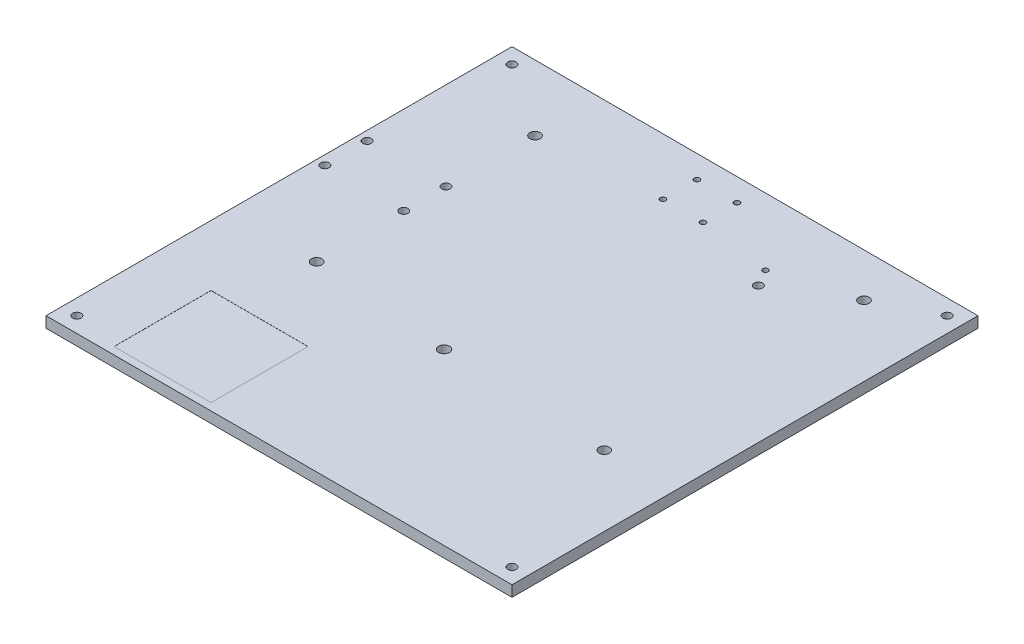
ISO-10303-21;
HEADER;
FILE_DESCRIPTION(('STEP AP214'),'2;1');
FILE_NAME('part.step','',(''),(''),'','','');
FILE_SCHEMA(('AUTOMOTIVE_DESIGN { 1 0 10303 214 1 1 1 1 }'));
ENDSEC;
DATA;
#1=APPLICATION_CONTEXT('core data for automotive mechanical design processes');
#2=APPLICATION_PROTOCOL_DEFINITION('international standard','automotive_design',2000,#1);
#3=PRODUCT_CONTEXT('',#1,'mechanical');
#4=PRODUCT('Part','Part','',(#3));
#5=PRODUCT_RELATED_PRODUCT_CATEGORY('part','',(#4));
#6=PRODUCT_DEFINITION_FORMATION('','',#4);
#7=PRODUCT_DEFINITION_CONTEXT('part definition',#1,'design');
#8=PRODUCT_DEFINITION('design','',#6,#7);
#9=PRODUCT_DEFINITION_SHAPE('','',#8);
#10=(LENGTH_UNIT() NAMED_UNIT(*) SI_UNIT(.MILLI.,.METRE.));
#11=(NAMED_UNIT(*) PLANE_ANGLE_UNIT() SI_UNIT($,.RADIAN.));
#12=(NAMED_UNIT(*) SI_UNIT($,.STERADIAN.) SOLID_ANGLE_UNIT());
#13=UNCERTAINTY_MEASURE_WITH_UNIT(LENGTH_MEASURE(1.E-05),#10,'distance_accuracy_value','');
#14=(GEOMETRIC_REPRESENTATION_CONTEXT(3) GLOBAL_UNCERTAINTY_ASSIGNED_CONTEXT((#13)) GLOBAL_UNIT_ASSIGNED_CONTEXT((#10,
#11,#12)) REPRESENTATION_CONTEXT('',''));
#15=CARTESIAN_POINT('',(0.,0.,0.));
#16=DIRECTION('',(0.,0.,1.));
#17=DIRECTION('',(1.,0.,0.));
#18=AXIS2_PLACEMENT_3D('',#15,#16,#17);
#19=CARTESIAN_POINT('',(0.,9.,0.));
#20=DIRECTION('',(0.,1.,0.));
#21=DIRECTION('',(0.,0.,1.));
#22=AXIS2_PLACEMENT_3D('',#19,#20,#21);
#23=PLANE('',#22);
#24=DIRECTION('',(0.,0.,1.));
#25=VECTOR('',#24,1.);
#26=CARTESIAN_POINT('',(58.5217380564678,9.,0.));
#27=LINE('',#26,#25);
#28=CARTESIAN_POINT('',(58.5217380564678,9.,-104.472034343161));
#29=VERTEX_POINT('',#28);
#30=CARTESIAN_POINT('',(58.5217380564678,9.,-24.4720343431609));
#31=VERTEX_POINT('',#30);
#32=EDGE_CURVE('E48',#29,#31,#27,.T.);
#33=ORIENTED_EDGE('',*,*,#32,.F.);
#34=DIRECTION('',(-1.,0.,0.));
#35=VECTOR('',#34,1.);
#36=CARTESIAN_POINT('',(0.,9.,-104.472034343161));
#37=LINE('',#36,#35);
#38=CARTESIAN_POINT('',(138.521738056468,9.,-104.472034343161));
#39=VERTEX_POINT('',#38);
#40=EDGE_CURVE('E127',#39,#29,#37,.T.);
#41=ORIENTED_EDGE('',*,*,#40,.F.);
#42=DIRECTION('',(0.,0.,-1.));
#43=VECTOR('',#42,1.);
#44=CARTESIAN_POINT('',(138.521738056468,9.,0.));
#45=LINE('',#44,#43);
#46=CARTESIAN_POINT('',(138.521738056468,9.,-24.4720343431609));
#47=VERTEX_POINT('',#46);
#48=EDGE_CURVE('E130',#47,#39,#45,.T.);
#49=ORIENTED_EDGE('',*,*,#48,.F.);
#50=DIRECTION('',(1.,0.,0.));
#51=VECTOR('',#50,1.);
#52=CARTESIAN_POINT('',(0.,9.,-24.4720343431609));
#53=LINE('',#52,#51);
#54=EDGE_CURVE('E136',#31,#47,#53,.T.);
#55=ORIENTED_EDGE('',*,*,#54,.F.);
#56=EDGE_LOOP('',(#33,#41,#49,#55));
#57=FACE_BOUND('',#56,.T.);
#58=CARTESIAN_POINT('',(212.621738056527,9.,-355.772034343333));
#59=DIRECTION('',(0.,1.,0.));
#60=DIRECTION('',(0.,0.,1.));
#61=AXIS2_PLACEMENT_3D('',#58,#59,#60);
#62=CIRCLE('',#61,2.25000000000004);
#63=CARTESIAN_POINT('',(212.621738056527,9.,-353.522034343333));
#64=VERTEX_POINT('',#63);
#65=EDGE_CURVE('E152',#64,#64,#62,.T.);
#66=ORIENTED_EDGE('',*,*,#65,.F.);
#67=EDGE_LOOP('',(#66));
#68=FACE_BOUND('',#67,.T.);
#69=CARTESIAN_POINT('',(179.621738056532,9.,-383.772034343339));
#70=DIRECTION('',(0.,1.,0.));
#71=DIRECTION('',(0.,0.,1.));
#72=AXIS2_PLACEMENT_3D('',#69,#70,#71);
#73=CIRCLE('',#72,2.25000000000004);
#74=CARTESIAN_POINT('',(179.621738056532,9.,-381.522034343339));
#75=VERTEX_POINT('',#74);
#76=EDGE_CURVE('E164',#75,#75,#73,.T.);
#77=ORIENTED_EDGE('',*,*,#76,.F.);
#78=EDGE_LOOP('',(#77));
#79=FACE_BOUND('',#78,.T.);
#80=CARTESIAN_POINT('',(81.0943470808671,9.,-275.472034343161));
#81=DIRECTION('',(0.,1.,0.));
#82=DIRECTION('',(0.,0.,1.));
#83=AXIS2_PLACEMENT_3D('',#80,#81,#82);
#84=CIRCLE('',#83,3.49999999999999);
#85=CARTESIAN_POINT('',(81.0943470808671,9.,-271.972034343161));
#86=VERTEX_POINT('',#85);
#87=EDGE_CURVE('E176',#86,#86,#84,.T.);
#88=ORIENTED_EDGE('',*,*,#87,.F.);
#89=EDGE_LOOP('',(#88));
#90=FACE_BOUND('',#89,.T.);
#91=CARTESIAN_POINT('',(16.0943470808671,9.,-240.696340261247));
#92=DIRECTION('',(0.,1.,0.));
#93=DIRECTION('',(0.,0.,1.));
#94=AXIS2_PLACEMENT_3D('',#91,#92,#93);
#95=CIRCLE('',#94,3.5);
#96=CARTESIAN_POINT('',(16.0943470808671,9.,-237.196340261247));
#97=VERTEX_POINT('',#96);
#98=EDGE_CURVE('E188',#97,#97,#95,.T.);
#99=ORIENTED_EDGE('',*,*,#98,.F.);
#100=EDGE_LOOP('',(#99));
#101=FACE_BOUND('',#100,.T.);
#102=CARTESIAN_POINT('',(379.821738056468,9.,-31.1720343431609));
#103=DIRECTION('',(0.,1.,0.));
#104=DIRECTION('',(0.,0.,1.));
#105=AXIS2_PLACEMENT_3D('',#102,#103,#104);
#106=CIRCLE('',#105,3.50000000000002);
#107=CARTESIAN_POINT('',(379.821738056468,9.,-27.6720343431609));
#108=VERTEX_POINT('',#107);
#109=EDGE_CURVE('E200',#108,#108,#106,.T.);
#110=ORIENTED_EDGE('',*,*,#109,.F.);
#111=EDGE_LOOP('',(#110));
#112=FACE_BOUND('',#111,.T.);
#113=CARTESIAN_POINT('',(272.521738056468,9.,-347.328440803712));
#114=DIRECTION('',(0.,1.,0.));
#115=DIRECTION('',(0.,0.,1.));
#116=AXIS2_PLACEMENT_3D('',#113,#114,#115);
#117=CIRCLE('',#116,2.19999999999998);
#118=CARTESIAN_POINT('',(272.521738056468,9.,-345.128440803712));
#119=VERTEX_POINT('',#118);
#120=EDGE_CURVE('E212',#119,#119,#117,.T.);
#121=ORIENTED_EDGE('',*,*,#120,.F.);
#122=EDGE_LOOP('',(#121));
#123=FACE_BOUND('',#122,.T.);
#124=CARTESIAN_POINT('',(334.521738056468,9.,-152.472034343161));
#125=DIRECTION('',(0.,1.,0.));
#126=DIRECTION('',(0.,0.,1.));
#127=AXIS2_PLACEMENT_3D('',#124,#125,#126);
#128=CIRCLE('',#127,4.30000000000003);
#129=CARTESIAN_POINT('',(334.521738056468,9.,-148.172034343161));
#130=VERTEX_POINT('',#129);
#131=EDGE_CURVE('E224',#130,#130,#128,.T.);
#132=ORIENTED_EDGE('',*,*,#131,.F.);
#133=EDGE_LOOP('',(#132));
#134=FACE_BOUND('',#133,.T.);
#135=CARTESIAN_POINT('',(379.821738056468,9.,-389.772034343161));
#136=DIRECTION('',(0.,1.,0.));
#137=DIRECTION('',(0.,0.,1.));
#138=AXIS2_PLACEMENT_3D('',#135,#136,#137);
#139=CIRCLE('',#138,3.50000000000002);
#140=CARTESIAN_POINT('',(379.821738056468,9.,-386.272034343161));
#141=VERTEX_POINT('',#140);
#142=EDGE_CURVE('E236',#141,#141,#139,.T.);
#143=ORIENTED_EDGE('',*,*,#142,.F.);
#144=EDGE_LOOP('',(#143));
#145=FACE_BOUND('',#144,.T.);
#146=CARTESIAN_POINT('',(280.521738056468,9.,-333.472034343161));
#147=DIRECTION('',(0.,1.,0.));
#148=DIRECTION('',(0.,0.,1.));
#149=AXIS2_PLACEMENT_3D('',#146,#147,#148);
#150=CIRCLE('',#149,3.50000000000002);
#151=CARTESIAN_POINT('',(280.521738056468,9.,-329.972034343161));
#152=VERTEX_POINT('',#151);
#153=EDGE_CURVE('E248',#152,#152,#150,.T.);
#154=ORIENTED_EDGE('',*,*,#153,.F.);
#155=EDGE_LOOP('',(#154));
#156=FACE_BOUND('',#155,.T.);
#157=DIRECTION('',(0.,0.,1.));
#158=VECTOR('',#157,1.);
#159=CARTESIAN_POINT('',(8.52173805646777,9.,-402.472034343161));
#160=LINE('',#159,#158);
#161=CARTESIAN_POINT('',(8.52173805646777,9.,-402.472034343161));
#162=VERTEX_POINT('',#161);
#163=CARTESIAN_POINT('',(8.52173805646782,9.,-18.4720343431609));
#164=VERTEX_POINT('',#163);
#165=EDGE_CURVE('E260',#162,#164,#160,.T.);
#166=ORIENTED_EDGE('',*,*,#165,.T.);
#167=DIRECTION('',(1.,0.,0.));
#168=VECTOR('',#167,1.);
#169=CARTESIAN_POINT('',(8.52173805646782,9.,-18.4720343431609));
#170=LINE('',#169,#168);
#171=CARTESIAN_POINT('',(392.521738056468,9.,-18.4720343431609));
#172=VERTEX_POINT('',#171);
#173=EDGE_CURVE('E85',#164,#172,#170,.T.);
#174=ORIENTED_EDGE('',*,*,#173,.T.);
#175=DIRECTION('',(0.,0.,-1.));
#176=VECTOR('',#175,1.);
#177=CARTESIAN_POINT('',(392.521738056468,9.,-402.472034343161));
#178=LINE('',#177,#176);
#179=CARTESIAN_POINT('',(392.521738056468,9.,-402.472034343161));
#180=VERTEX_POINT('',#179);
#181=EDGE_CURVE('E263',#172,#180,#178,.T.);
#182=ORIENTED_EDGE('',*,*,#181,.T.);
#183=DIRECTION('',(-1.,0.,0.));
#184=VECTOR('',#183,1.);
#185=CARTESIAN_POINT('',(8.52173805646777,9.,-402.472034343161));
#186=LINE('',#185,#184);
#187=EDGE_CURVE('E57',#180,#162,#186,.T.);
#188=ORIENTED_EDGE('',*,*,#187,.T.);
#189=EDGE_LOOP('',(#166,#174,#182,#188));
#190=FACE_BOUND('',#189,.T.);
#191=CARTESIAN_POINT('',(21.2217380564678,9.,-389.772034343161));
#192=DIRECTION('',(0.,1.,0.));
#193=DIRECTION('',(0.,0.,1.));
#194=AXIS2_PLACEMENT_3D('',#191,#192,#193);
#195=CIRCLE('',#194,3.5);
#196=CARTESIAN_POINT('',(21.2217380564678,9.,-386.272034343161));
#197=VERTEX_POINT('',#196);
#198=EDGE_CURVE('E254',#197,#197,#195,.T.);
#199=ORIENTED_EDGE('',*,*,#198,.F.);
#200=EDGE_LOOP('',(#199));
#201=FACE_BOUND('',#200,.T.);
#202=CARTESIAN_POINT('',(81.5217380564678,9.,-348.472034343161));
#203=DIRECTION('',(0.,1.,0.));
#204=DIRECTION('',(0.,0.,1.));
#205=AXIS2_PLACEMENT_3D('',#202,#203,#204);
#206=CIRCLE('',#205,4.30000000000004);
#207=CARTESIAN_POINT('',(81.5217380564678,9.,-344.172034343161));
#208=VERTEX_POINT('',#207);
#209=EDGE_CURVE('E242',#208,#208,#206,.T.);
#210=ORIENTED_EDGE('',*,*,#209,.F.);
#211=EDGE_LOOP('',(#210));
#212=FACE_BOUND('',#211,.T.);
#213=CARTESIAN_POINT('',(196.521738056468,9.,-158.472034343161));
#214=DIRECTION('',(0.,1.,0.));
#215=DIRECTION('',(0.,0.,1.));
#216=AXIS2_PLACEMENT_3D('',#213,#214,#215);
#217=CIRCLE('',#216,4.49999999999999);
#218=CARTESIAN_POINT('',(196.521738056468,9.,-153.972034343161));
#219=VERTEX_POINT('',#218);
#220=EDGE_CURVE('E230',#219,#219,#217,.T.);
#221=ORIENTED_EDGE('',*,*,#220,.F.);
#222=EDGE_LOOP('',(#221));
#223=FACE_BOUND('',#222,.T.);
#224=CARTESIAN_POINT('',(81.5217380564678,9.,-168.472034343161));
#225=DIRECTION('',(0.,1.,0.));
#226=DIRECTION('',(0.,0.,1.));
#227=AXIS2_PLACEMENT_3D('',#224,#225,#226);
#228=CIRCLE('',#227,4.3);
#229=CARTESIAN_POINT('',(81.5217380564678,9.,-164.172034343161));
#230=VERTEX_POINT('',#229);
#231=EDGE_CURVE('E218',#230,#230,#228,.T.);
#232=ORIENTED_EDGE('',*,*,#231,.F.);
#233=EDGE_LOOP('',(#232));
#234=FACE_BOUND('',#233,.T.);
#235=CARTESIAN_POINT('',(334.521738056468,9.,-366.472034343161));
#236=DIRECTION('',(0.,1.,0.));
#237=DIRECTION('',(0.,0.,1.));
#238=AXIS2_PLACEMENT_3D('',#235,#236,#237);
#239=CIRCLE('',#238,4.30000000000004);
#240=CARTESIAN_POINT('',(334.521738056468,9.,-362.172034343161));
#241=VERTEX_POINT('',#240);
#242=EDGE_CURVE('E206',#241,#241,#239,.T.);
#243=ORIENTED_EDGE('',*,*,#242,.F.);
#244=EDGE_LOOP('',(#243));
#245=FACE_BOUND('',#244,.T.);
#246=CARTESIAN_POINT('',(21.2217380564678,9.,-31.1720343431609));
#247=DIRECTION('',(0.,1.,0.));
#248=DIRECTION('',(0.,0.,1.));
#249=AXIS2_PLACEMENT_3D('',#246,#247,#248);
#250=CIRCLE('',#249,3.5);
#251=CARTESIAN_POINT('',(21.2217380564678,9.,-27.6720343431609));
#252=VERTEX_POINT('',#251);
#253=EDGE_CURVE('E194',#252,#252,#250,.T.);
#254=ORIENTED_EDGE('',*,*,#253,.F.);
#255=EDGE_LOOP('',(#254));
#256=FACE_BOUND('',#255,.T.);
#257=CARTESIAN_POINT('',(16.0943470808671,9.,-275.472034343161));
#258=DIRECTION('',(0.,1.,0.));
#259=DIRECTION('',(0.,0.,1.));
#260=AXIS2_PLACEMENT_3D('',#257,#258,#259);
#261=CIRCLE('',#260,3.49999999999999);
#262=CARTESIAN_POINT('',(16.0943470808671,9.,-271.972034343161));
#263=VERTEX_POINT('',#262);
#264=EDGE_CURVE('E182',#263,#263,#261,.T.);
#265=ORIENTED_EDGE('',*,*,#264,.F.);
#266=EDGE_LOOP('',(#265));
#267=FACE_BOUND('',#266,.T.);
#268=CARTESIAN_POINT('',(81.0943470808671,9.,-240.696340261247));
#269=DIRECTION('',(0.,1.,0.));
#270=DIRECTION('',(0.,0.,1.));
#271=AXIS2_PLACEMENT_3D('',#268,#269,#270);
#272=CIRCLE('',#271,3.49999999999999);
#273=CARTESIAN_POINT('',(81.0943470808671,9.,-237.196340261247));
#274=VERTEX_POINT('',#273);
#275=EDGE_CURVE('E170',#274,#274,#272,.T.);
#276=ORIENTED_EDGE('',*,*,#275,.F.);
#277=EDGE_LOOP('',(#276));
#278=FACE_BOUND('',#277,.T.);
#279=CARTESIAN_POINT('',(179.621738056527,9.,-355.772034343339));
#280=DIRECTION('',(0.,1.,0.));
#281=DIRECTION('',(0.,0.,1.));
#282=AXIS2_PLACEMENT_3D('',#279,#280,#281);
#283=CIRCLE('',#282,2.24999999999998);
#284=CARTESIAN_POINT('',(179.621738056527,9.,-353.522034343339));
#285=VERTEX_POINT('',#284);
#286=EDGE_CURVE('E158',#285,#285,#283,.T.);
#287=ORIENTED_EDGE('',*,*,#286,.F.);
#288=EDGE_LOOP('',(#287));
#289=FACE_BOUND('',#288,.T.);
#290=CARTESIAN_POINT('',(212.621738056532,9.,-383.772034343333));
#291=DIRECTION('',(0.,1.,0.));
#292=DIRECTION('',(0.,0.,1.));
#293=AXIS2_PLACEMENT_3D('',#290,#291,#292);
#294=CIRCLE('',#293,2.24999999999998);
#295=CARTESIAN_POINT('',(212.621738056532,9.,-381.522034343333));
#296=VERTEX_POINT('',#295);
#297=EDGE_CURVE('E146',#296,#296,#294,.T.);
#298=ORIENTED_EDGE('',*,*,#297,.F.);
#299=EDGE_LOOP('',(#298));
#300=FACE_BOUND('',#299,.T.);
#301=ADVANCED_FACE('F33',(#57,#68,#79,#90,#101,#112,#123,#134,#145,#156,#190,#201,#212,#223,
#234,#245,#256,#267,#278,#289,#300),#23,.T.);
#302=CARTESIAN_POINT('',(0.,0.,0.));
#303=DIRECTION('',(0.,1.,0.));
#304=DIRECTION('',(0.,0.,1.));
#305=AXIS2_PLACEMENT_3D('',#302,#303,#304);
#306=PLANE('',#305);
#307=DIRECTION('',(0.,0.,1.));
#308=VECTOR('',#307,1.);
#309=CARTESIAN_POINT('',(8.52173805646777,0.,-402.472034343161));
#310=LINE('',#309,#308);
#311=CARTESIAN_POINT('',(8.52173805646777,0.,-402.472034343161));
#312=VERTEX_POINT('',#311);
#313=CARTESIAN_POINT('',(8.52173805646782,0.,-18.4720343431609));
#314=VERTEX_POINT('',#313);
#315=EDGE_CURVE('E257',#312,#314,#310,.T.);
#316=ORIENTED_EDGE('',*,*,#315,.F.);
#317=DIRECTION('',(-1.,0.,0.));
#318=VECTOR('',#317,1.);
#319=CARTESIAN_POINT('',(8.52173805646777,0.,-402.472034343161));
#320=LINE('',#319,#318);
#321=CARTESIAN_POINT('',(392.521738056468,0.,-402.472034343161));
#322=VERTEX_POINT('',#321);
#323=EDGE_CURVE('E78',#322,#312,#320,.T.);
#324=ORIENTED_EDGE('',*,*,#323,.F.);
#325=DIRECTION('',(0.,0.,-1.));
#326=VECTOR('',#325,1.);
#327=CARTESIAN_POINT('',(392.521738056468,0.,-402.472034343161));
#328=LINE('',#327,#326);
#329=CARTESIAN_POINT('',(392.521738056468,0.,-18.4720343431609));
#330=VERTEX_POINT('',#329);
#331=EDGE_CURVE('E271',#330,#322,#328,.T.);
#332=ORIENTED_EDGE('',*,*,#331,.F.);
#333=DIRECTION('',(1.,0.,0.));
#334=VECTOR('',#333,1.);
#335=CARTESIAN_POINT('',(8.52173805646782,0.,-18.4720343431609));
#336=LINE('',#335,#334);
#337=EDGE_CURVE('E269',#314,#330,#336,.T.);
#338=ORIENTED_EDGE('',*,*,#337,.F.);
#339=EDGE_LOOP('',(#316,#324,#332,#338));
#340=FACE_BOUND('',#339,.T.);
#341=CARTESIAN_POINT('',(21.2217380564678,0.,-389.772034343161));
#342=DIRECTION('',(0.,1.,0.));
#343=DIRECTION('',(0.,0.,1.));
#344=AXIS2_PLACEMENT_3D('',#341,#342,#343);
#345=CIRCLE('',#344,3.5);
#346=CARTESIAN_POINT('',(21.2217380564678,0.,-386.272034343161));
#347=VERTEX_POINT('',#346);
#348=EDGE_CURVE('E251',#347,#347,#345,.T.);
#349=ORIENTED_EDGE('',*,*,#348,.T.);
#350=EDGE_LOOP('',(#349));
#351=FACE_BOUND('',#350,.T.);
#352=CARTESIAN_POINT('',(280.521738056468,0.,-333.472034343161));
#353=DIRECTION('',(0.,1.,0.));
#354=DIRECTION('',(0.,0.,1.));
#355=AXIS2_PLACEMENT_3D('',#352,#353,#354);
#356=CIRCLE('',#355,3.50000000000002);
#357=CARTESIAN_POINT('',(280.521738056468,0.,-329.972034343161));
#358=VERTEX_POINT('',#357);
#359=EDGE_CURVE('E245',#358,#358,#356,.T.);
#360=ORIENTED_EDGE('',*,*,#359,.T.);
#361=EDGE_LOOP('',(#360));
#362=FACE_BOUND('',#361,.T.);
#363=CARTESIAN_POINT('',(81.5217380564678,0.,-348.472034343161));
#364=DIRECTION('',(0.,1.,0.));
#365=DIRECTION('',(0.,0.,1.));
#366=AXIS2_PLACEMENT_3D('',#363,#364,#365);
#367=CIRCLE('',#366,4.30000000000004);
#368=CARTESIAN_POINT('',(81.5217380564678,0.,-344.172034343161));
#369=VERTEX_POINT('',#368);
#370=EDGE_CURVE('E239',#369,#369,#367,.T.);
#371=ORIENTED_EDGE('',*,*,#370,.T.);
#372=EDGE_LOOP('',(#371));
#373=FACE_BOUND('',#372,.T.);
#374=CARTESIAN_POINT('',(379.821738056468,0.,-389.772034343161));
#375=DIRECTION('',(0.,1.,0.));
#376=DIRECTION('',(0.,0.,1.));
#377=AXIS2_PLACEMENT_3D('',#374,#375,#376);
#378=CIRCLE('',#377,3.50000000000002);
#379=CARTESIAN_POINT('',(379.821738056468,0.,-386.272034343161));
#380=VERTEX_POINT('',#379);
#381=EDGE_CURVE('E233',#380,#380,#378,.T.);
#382=ORIENTED_EDGE('',*,*,#381,.T.);
#383=EDGE_LOOP('',(#382));
#384=FACE_BOUND('',#383,.T.);
#385=CARTESIAN_POINT('',(196.521738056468,0.,-158.472034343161));
#386=DIRECTION('',(0.,1.,0.));
#387=DIRECTION('',(0.,0.,1.));
#388=AXIS2_PLACEMENT_3D('',#385,#386,#387);
#389=CIRCLE('',#388,4.49999999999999);
#390=CARTESIAN_POINT('',(196.521738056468,0.,-153.972034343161));
#391=VERTEX_POINT('',#390);
#392=EDGE_CURVE('E227',#391,#391,#389,.T.);
#393=ORIENTED_EDGE('',*,*,#392,.T.);
#394=EDGE_LOOP('',(#393));
#395=FACE_BOUND('',#394,.T.);
#396=CARTESIAN_POINT('',(334.521738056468,0.,-152.472034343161));
#397=DIRECTION('',(0.,1.,0.));
#398=DIRECTION('',(0.,0.,1.));
#399=AXIS2_PLACEMENT_3D('',#396,#397,#398);
#400=CIRCLE('',#399,4.30000000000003);
#401=CARTESIAN_POINT('',(334.521738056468,0.,-148.172034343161));
#402=VERTEX_POINT('',#401);
#403=EDGE_CURVE('E221',#402,#402,#400,.T.);
#404=ORIENTED_EDGE('',*,*,#403,.T.);
#405=EDGE_LOOP('',(#404));
#406=FACE_BOUND('',#405,.T.);
#407=CARTESIAN_POINT('',(81.5217380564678,0.,-168.472034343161));
#408=DIRECTION('',(0.,1.,0.));
#409=DIRECTION('',(0.,0.,1.));
#410=AXIS2_PLACEMENT_3D('',#407,#408,#409);
#411=CIRCLE('',#410,4.3);
#412=CARTESIAN_POINT('',(81.5217380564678,0.,-164.172034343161));
#413=VERTEX_POINT('',#412);
#414=EDGE_CURVE('E215',#413,#413,#411,.T.);
#415=ORIENTED_EDGE('',*,*,#414,.T.);
#416=EDGE_LOOP('',(#415));
#417=FACE_BOUND('',#416,.T.);
#418=CARTESIAN_POINT('',(272.521738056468,0.,-347.328440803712));
#419=DIRECTION('',(0.,1.,0.));
#420=DIRECTION('',(0.,0.,1.));
#421=AXIS2_PLACEMENT_3D('',#418,#419,#420);
#422=CIRCLE('',#421,2.19999999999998);
#423=CARTESIAN_POINT('',(272.521738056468,0.,-345.128440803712));
#424=VERTEX_POINT('',#423);
#425=EDGE_CURVE('E209',#424,#424,#422,.T.);
#426=ORIENTED_EDGE('',*,*,#425,.T.);
#427=EDGE_LOOP('',(#426));
#428=FACE_BOUND('',#427,.T.);
#429=CARTESIAN_POINT('',(334.521738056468,0.,-366.472034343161));
#430=DIRECTION('',(0.,1.,0.));
#431=DIRECTION('',(0.,0.,1.));
#432=AXIS2_PLACEMENT_3D('',#429,#430,#431);
#433=CIRCLE('',#432,4.30000000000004);
#434=CARTESIAN_POINT('',(334.521738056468,0.,-362.172034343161));
#435=VERTEX_POINT('',#434);
#436=EDGE_CURVE('E203',#435,#435,#433,.T.);
#437=ORIENTED_EDGE('',*,*,#436,.T.);
#438=EDGE_LOOP('',(#437));
#439=FACE_BOUND('',#438,.T.);
#440=CARTESIAN_POINT('',(379.821738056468,0.,-31.1720343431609));
#441=DIRECTION('',(0.,1.,0.));
#442=DIRECTION('',(0.,0.,1.));
#443=AXIS2_PLACEMENT_3D('',#440,#441,#442);
#444=CIRCLE('',#443,3.50000000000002);
#445=CARTESIAN_POINT('',(379.821738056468,0.,-27.6720343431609));
#446=VERTEX_POINT('',#445);
#447=EDGE_CURVE('E197',#446,#446,#444,.T.);
#448=ORIENTED_EDGE('',*,*,#447,.T.);
#449=EDGE_LOOP('',(#448));
#450=FACE_BOUND('',#449,.T.);
#451=CARTESIAN_POINT('',(21.2217380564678,0.,-31.1720343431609));
#452=DIRECTION('',(0.,1.,0.));
#453=DIRECTION('',(0.,0.,1.));
#454=AXIS2_PLACEMENT_3D('',#451,#452,#453);
#455=CIRCLE('',#454,3.5);
#456=CARTESIAN_POINT('',(21.2217380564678,0.,-27.6720343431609));
#457=VERTEX_POINT('',#456);
#458=EDGE_CURVE('E191',#457,#457,#455,.T.);
#459=ORIENTED_EDGE('',*,*,#458,.T.);
#460=EDGE_LOOP('',(#459));
#461=FACE_BOUND('',#460,.T.);
#462=CARTESIAN_POINT('',(16.0943470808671,0.,-240.696340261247));
#463=DIRECTION('',(0.,1.,0.));
#464=DIRECTION('',(0.,0.,1.));
#465=AXIS2_PLACEMENT_3D('',#462,#463,#464);
#466=CIRCLE('',#465,3.5);
#467=CARTESIAN_POINT('',(16.0943470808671,0.,-237.196340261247));
#468=VERTEX_POINT('',#467);
#469=EDGE_CURVE('E185',#468,#468,#466,.T.);
#470=ORIENTED_EDGE('',*,*,#469,.T.);
#471=EDGE_LOOP('',(#470));
#472=FACE_BOUND('',#471,.T.);
#473=CARTESIAN_POINT('',(16.0943470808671,0.,-275.472034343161));
#474=DIRECTION('',(0.,1.,0.));
#475=DIRECTION('',(0.,0.,1.));
#476=AXIS2_PLACEMENT_3D('',#473,#474,#475);
#477=CIRCLE('',#476,3.49999999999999);
#478=CARTESIAN_POINT('',(16.0943470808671,0.,-271.972034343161));
#479=VERTEX_POINT('',#478);
#480=EDGE_CURVE('E179',#479,#479,#477,.T.);
#481=ORIENTED_EDGE('',*,*,#480,.T.);
#482=EDGE_LOOP('',(#481));
#483=FACE_BOUND('',#482,.T.);
#484=CARTESIAN_POINT('',(81.0943470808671,0.,-275.472034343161));
#485=DIRECTION('',(0.,1.,0.));
#486=DIRECTION('',(0.,0.,1.));
#487=AXIS2_PLACEMENT_3D('',#484,#485,#486);
#488=CIRCLE('',#487,3.49999999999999);
#489=CARTESIAN_POINT('',(81.0943470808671,0.,-271.972034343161));
#490=VERTEX_POINT('',#489);
#491=EDGE_CURVE('E173',#490,#490,#488,.T.);
#492=ORIENTED_EDGE('',*,*,#491,.T.);
#493=EDGE_LOOP('',(#492));
#494=FACE_BOUND('',#493,.T.);
#495=CARTESIAN_POINT('',(81.0943470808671,0.,-240.696340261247));
#496=DIRECTION('',(0.,1.,0.));
#497=DIRECTION('',(0.,0.,1.));
#498=AXIS2_PLACEMENT_3D('',#495,#496,#497);
#499=CIRCLE('',#498,3.49999999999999);
#500=CARTESIAN_POINT('',(81.0943470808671,0.,-237.196340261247));
#501=VERTEX_POINT('',#500);
#502=EDGE_CURVE('E167',#501,#501,#499,.T.);
#503=ORIENTED_EDGE('',*,*,#502,.T.);
#504=EDGE_LOOP('',(#503));
#505=FACE_BOUND('',#504,.T.);
#506=CARTESIAN_POINT('',(179.621738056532,0.,-383.772034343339));
#507=DIRECTION('',(0.,1.,0.));
#508=DIRECTION('',(0.,0.,1.));
#509=AXIS2_PLACEMENT_3D('',#506,#507,#508);
#510=CIRCLE('',#509,2.25000000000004);
#511=CARTESIAN_POINT('',(179.621738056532,0.,-381.522034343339));
#512=VERTEX_POINT('',#511);
#513=EDGE_CURVE('E161',#512,#512,#510,.T.);
#514=ORIENTED_EDGE('',*,*,#513,.T.);
#515=EDGE_LOOP('',(#514));
#516=FACE_BOUND('',#515,.T.);
#517=CARTESIAN_POINT('',(179.621738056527,0.,-355.772034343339));
#518=DIRECTION('',(0.,1.,0.));
#519=DIRECTION('',(0.,0.,1.));
#520=AXIS2_PLACEMENT_3D('',#517,#518,#519);
#521=CIRCLE('',#520,2.24999999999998);
#522=CARTESIAN_POINT('',(179.621738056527,0.,-353.522034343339));
#523=VERTEX_POINT('',#522);
#524=EDGE_CURVE('E155',#523,#523,#521,.T.);
#525=ORIENTED_EDGE('',*,*,#524,.T.);
#526=EDGE_LOOP('',(#525));
#527=FACE_BOUND('',#526,.T.);
#528=CARTESIAN_POINT('',(212.621738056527,0.,-355.772034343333));
#529=DIRECTION('',(0.,1.,0.));
#530=DIRECTION('',(0.,0.,1.));
#531=AXIS2_PLACEMENT_3D('',#528,#529,#530);
#532=CIRCLE('',#531,2.25000000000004);
#533=CARTESIAN_POINT('',(212.621738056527,0.,-353.522034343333));
#534=VERTEX_POINT('',#533);
#535=EDGE_CURVE('E149',#534,#534,#532,.T.);
#536=ORIENTED_EDGE('',*,*,#535,.T.);
#537=EDGE_LOOP('',(#536));
#538=FACE_BOUND('',#537,.T.);
#539=CARTESIAN_POINT('',(212.621738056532,0.,-383.772034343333));
#540=DIRECTION('',(0.,1.,0.));
#541=DIRECTION('',(0.,0.,1.));
#542=AXIS2_PLACEMENT_3D('',#539,#540,#541);
#543=CIRCLE('',#542,2.24999999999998);
#544=CARTESIAN_POINT('',(212.621738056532,0.,-381.522034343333));
#545=VERTEX_POINT('',#544);
#546=EDGE_CURVE('E142',#545,#545,#543,.T.);
#547=ORIENTED_EDGE('',*,*,#546,.T.);
#548=EDGE_LOOP('',(#547));
#549=FACE_BOUND('',#548,.T.);
#550=ADVANCED_FACE('F284',(#340,#351,#362,#373,#384,#395,#406,#417,#428,#439,#450,#461,#472,
#483,#494,#505,#516,#527,#538,#549),#306,.F.);
#551=CARTESIAN_POINT('',(8.52173805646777,9.,-402.472034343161));
#552=DIRECTION('',(1.,0.,0.));
#553=DIRECTION('',(0.,0.,-1.));
#554=AXIS2_PLACEMENT_3D('',#551,#552,#553);
#555=PLANE('',#554);
#556=ORIENTED_EDGE('',*,*,#315,.T.);
#557=DIRECTION('',(0.,-1.,0.));
#558=VECTOR('',#557,1.);
#559=CARTESIAN_POINT('',(8.52173805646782,9.,-18.4720343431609));
#560=LINE('',#559,#558);
#561=EDGE_CURVE('E11',#164,#314,#560,.T.);
#562=ORIENTED_EDGE('',*,*,#561,.F.);
#563=ORIENTED_EDGE('',*,*,#165,.F.);
#564=DIRECTION('',(0.,-1.,0.));
#565=VECTOR('',#564,1.);
#566=CARTESIAN_POINT('',(8.52173805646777,9.,-402.472034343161));
#567=LINE('',#566,#565);
#568=EDGE_CURVE('E266',#162,#312,#567,.T.);
#569=ORIENTED_EDGE('',*,*,#568,.T.);
#570=EDGE_LOOP('',(#556,#562,#563,#569));
#571=FACE_BOUND('',#570,.T.);
#572=ADVANCED_FACE('F35',(#571),#555,.F.);
#573=CARTESIAN_POINT('',(8.52173805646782,9.,-18.4720343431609));
#574=DIRECTION('',(0.,0.,-1.));
#575=DIRECTION('',(-1.,0.,0.));
#576=AXIS2_PLACEMENT_3D('',#573,#574,#575);
#577=PLANE('',#576);
#578=ORIENTED_EDGE('',*,*,#337,.T.);
#579=DIRECTION('',(0.,-1.,0.));
#580=VECTOR('',#579,1.);
#581=CARTESIAN_POINT('',(392.521738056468,9.,-18.4720343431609));
#582=LINE('',#581,#580);
#583=EDGE_CURVE('E41',#172,#330,#582,.T.);
#584=ORIENTED_EDGE('',*,*,#583,.F.);
#585=ORIENTED_EDGE('',*,*,#173,.F.);
#586=ORIENTED_EDGE('',*,*,#561,.T.);
#587=EDGE_LOOP('',(#578,#584,#585,#586));
#588=FACE_BOUND('',#587,.T.);
#589=ADVANCED_FACE('F300',(#588),#577,.F.);
#590=CARTESIAN_POINT('',(392.521738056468,9.,-402.472034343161));
#591=DIRECTION('',(-1.,0.,0.));
#592=DIRECTION('',(0.,0.,1.));
#593=AXIS2_PLACEMENT_3D('',#590,#591,#592);
#594=PLANE('',#593);
#595=ORIENTED_EDGE('',*,*,#331,.T.);
#596=DIRECTION('',(0.,-1.,0.));
#597=VECTOR('',#596,1.);
#598=CARTESIAN_POINT('',(392.521738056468,9.,-402.472034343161));
#599=LINE('',#598,#597);
#600=EDGE_CURVE('E275',#180,#322,#599,.T.);
#601=ORIENTED_EDGE('',*,*,#600,.F.);
#602=ORIENTED_EDGE('',*,*,#181,.F.);
#603=ORIENTED_EDGE('',*,*,#583,.T.);
#604=EDGE_LOOP('',(#595,#601,#602,#603));
#605=FACE_BOUND('',#604,.T.);
#606=ADVANCED_FACE('F280',(#605),#594,.F.);
#607=CARTESIAN_POINT('',(8.52173805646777,9.,-402.472034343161));
#608=DIRECTION('',(0.,0.,1.));
#609=DIRECTION('',(1.,0.,0.));
#610=AXIS2_PLACEMENT_3D('',#607,#608,#609);
#611=PLANE('',#610);
#612=ORIENTED_EDGE('',*,*,#323,.T.);
#613=ORIENTED_EDGE('',*,*,#568,.F.);
#614=ORIENTED_EDGE('',*,*,#187,.F.);
#615=ORIENTED_EDGE('',*,*,#600,.T.);
#616=EDGE_LOOP('',(#612,#613,#614,#615));
#617=FACE_BOUND('',#616,.T.);
#618=ADVANCED_FACE('F289',(#617),#611,.F.);
#619=CARTESIAN_POINT('',(21.2217380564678,9.,-389.772034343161));
#620=DIRECTION('',(0.,-1.,0.));
#621=DIRECTION('',(0.,0.,-1.));
#622=AXIS2_PLACEMENT_3D('',#619,#620,#621);
#623=CYLINDRICAL_SURFACE('',#622,3.5);
#624=ORIENTED_EDGE('',*,*,#198,.T.);
#625=EDGE_LOOP('',(#624));
#626=FACE_BOUND('',#625,.T.);
#627=ORIENTED_EDGE('',*,*,#348,.F.);
#628=EDGE_LOOP('',(#627));
#629=FACE_BOUND('',#628,.T.);
#630=ADVANCED_FACE('F291',(#626,#629),#623,.F.);
#631=CARTESIAN_POINT('',(280.521738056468,9.,-333.472034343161));
#632=DIRECTION('',(0.,-1.,0.));
#633=DIRECTION('',(0.,0.,-1.));
#634=AXIS2_PLACEMENT_3D('',#631,#632,#633);
#635=CYLINDRICAL_SURFACE('',#634,3.50000000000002);
#636=ORIENTED_EDGE('',*,*,#153,.T.);
#637=EDGE_LOOP('',(#636));
#638=FACE_BOUND('',#637,.T.);
#639=ORIENTED_EDGE('',*,*,#359,.F.);
#640=EDGE_LOOP('',(#639));
#641=FACE_BOUND('',#640,.T.);
#642=ADVANCED_FACE('F297',(#638,#641),#635,.F.);
#643=CARTESIAN_POINT('',(81.5217380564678,9.,-348.472034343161));
#644=DIRECTION('',(0.,-1.,0.));
#645=DIRECTION('',(0.,0.,-1.));
#646=AXIS2_PLACEMENT_3D('',#643,#644,#645);
#647=CYLINDRICAL_SURFACE('',#646,4.30000000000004);
#648=ORIENTED_EDGE('',*,*,#209,.T.);
#649=EDGE_LOOP('',(#648));
#650=FACE_BOUND('',#649,.T.);
#651=ORIENTED_EDGE('',*,*,#370,.F.);
#652=EDGE_LOOP('',(#651));
#653=FACE_BOUND('',#652,.T.);
#654=ADVANCED_FACE('F313',(#650,#653),#647,.F.);
#655=CARTESIAN_POINT('',(379.821738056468,9.,-389.772034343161));
#656=DIRECTION('',(0.,-1.,0.));
#657=DIRECTION('',(0.,0.,-1.));
#658=AXIS2_PLACEMENT_3D('',#655,#656,#657);
#659=CYLINDRICAL_SURFACE('',#658,3.50000000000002);
#660=ORIENTED_EDGE('',*,*,#142,.T.);
#661=EDGE_LOOP('',(#660));
#662=FACE_BOUND('',#661,.T.);
#663=ORIENTED_EDGE('',*,*,#381,.F.);
#664=EDGE_LOOP('',(#663));
#665=FACE_BOUND('',#664,.T.);
#666=ADVANCED_FACE('F317',(#662,#665),#659,.F.);
#667=CARTESIAN_POINT('',(196.521738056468,9.,-158.472034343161));
#668=DIRECTION('',(0.,-1.,0.));
#669=DIRECTION('',(0.,0.,-1.));
#670=AXIS2_PLACEMENT_3D('',#667,#668,#669);
#671=CYLINDRICAL_SURFACE('',#670,4.49999999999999);
#672=ORIENTED_EDGE('',*,*,#220,.T.);
#673=EDGE_LOOP('',(#672));
#674=FACE_BOUND('',#673,.T.);
#675=ORIENTED_EDGE('',*,*,#392,.F.);
#676=EDGE_LOOP('',(#675));
#677=FACE_BOUND('',#676,.T.);
#678=ADVANCED_FACE('F321',(#674,#677),#671,.F.);
#679=CARTESIAN_POINT('',(334.521738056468,9.,-152.472034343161));
#680=DIRECTION('',(0.,-1.,0.));
#681=DIRECTION('',(0.,0.,-1.));
#682=AXIS2_PLACEMENT_3D('',#679,#680,#681);
#683=CYLINDRICAL_SURFACE('',#682,4.30000000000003);
#684=ORIENTED_EDGE('',*,*,#131,.T.);
#685=EDGE_LOOP('',(#684));
#686=FACE_BOUND('',#685,.T.);
#687=ORIENTED_EDGE('',*,*,#403,.F.);
#688=EDGE_LOOP('',(#687));
#689=FACE_BOUND('',#688,.T.);
#690=ADVANCED_FACE('F325',(#686,#689),#683,.F.);
#691=CARTESIAN_POINT('',(81.5217380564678,9.,-168.472034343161));
#692=DIRECTION('',(0.,-1.,0.));
#693=DIRECTION('',(0.,0.,-1.));
#694=AXIS2_PLACEMENT_3D('',#691,#692,#693);
#695=CYLINDRICAL_SURFACE('',#694,4.3);
#696=ORIENTED_EDGE('',*,*,#231,.T.);
#697=EDGE_LOOP('',(#696));
#698=FACE_BOUND('',#697,.T.);
#699=ORIENTED_EDGE('',*,*,#414,.F.);
#700=EDGE_LOOP('',(#699));
#701=FACE_BOUND('',#700,.T.);
#702=ADVANCED_FACE('F329',(#698,#701),#695,.F.);
#703=CARTESIAN_POINT('',(272.521738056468,9.,-347.328440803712));
#704=DIRECTION('',(0.,-1.,0.));
#705=DIRECTION('',(0.,0.,-1.));
#706=AXIS2_PLACEMENT_3D('',#703,#704,#705);
#707=CYLINDRICAL_SURFACE('',#706,2.19999999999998);
#708=ORIENTED_EDGE('',*,*,#120,.T.);
#709=EDGE_LOOP('',(#708));
#710=FACE_BOUND('',#709,.T.);
#711=ORIENTED_EDGE('',*,*,#425,.F.);
#712=EDGE_LOOP('',(#711));
#713=FACE_BOUND('',#712,.T.);
#714=ADVANCED_FACE('F333',(#710,#713),#707,.F.);
#715=CARTESIAN_POINT('',(334.521738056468,9.,-366.472034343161));
#716=DIRECTION('',(0.,-1.,0.));
#717=DIRECTION('',(0.,0.,-1.));
#718=AXIS2_PLACEMENT_3D('',#715,#716,#717);
#719=CYLINDRICAL_SURFACE('',#718,4.30000000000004);
#720=ORIENTED_EDGE('',*,*,#242,.T.);
#721=EDGE_LOOP('',(#720));
#722=FACE_BOUND('',#721,.T.);
#723=ORIENTED_EDGE('',*,*,#436,.F.);
#724=EDGE_LOOP('',(#723));
#725=FACE_BOUND('',#724,.T.);
#726=ADVANCED_FACE('F337',(#722,#725),#719,.F.);
#727=CARTESIAN_POINT('',(379.821738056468,9.,-31.1720343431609));
#728=DIRECTION('',(0.,-1.,0.));
#729=DIRECTION('',(0.,0.,-1.));
#730=AXIS2_PLACEMENT_3D('',#727,#728,#729);
#731=CYLINDRICAL_SURFACE('',#730,3.50000000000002);
#732=ORIENTED_EDGE('',*,*,#109,.T.);
#733=EDGE_LOOP('',(#732));
#734=FACE_BOUND('',#733,.T.);
#735=ORIENTED_EDGE('',*,*,#447,.F.);
#736=EDGE_LOOP('',(#735));
#737=FACE_BOUND('',#736,.T.);
#738=ADVANCED_FACE('F341',(#734,#737),#731,.F.);
#739=CARTESIAN_POINT('',(21.2217380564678,9.,-31.1720343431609));
#740=DIRECTION('',(0.,-1.,0.));
#741=DIRECTION('',(0.,0.,-1.));
#742=AXIS2_PLACEMENT_3D('',#739,#740,#741);
#743=CYLINDRICAL_SURFACE('',#742,3.5);
#744=ORIENTED_EDGE('',*,*,#253,.T.);
#745=EDGE_LOOP('',(#744));
#746=FACE_BOUND('',#745,.T.);
#747=ORIENTED_EDGE('',*,*,#458,.F.);
#748=EDGE_LOOP('',(#747));
#749=FACE_BOUND('',#748,.T.);
#750=ADVANCED_FACE('F345',(#746,#749),#743,.F.);
#751=CARTESIAN_POINT('',(16.0943470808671,9.,-240.696340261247));
#752=DIRECTION('',(0.,-1.,0.));
#753=DIRECTION('',(0.,0.,-1.));
#754=AXIS2_PLACEMENT_3D('',#751,#752,#753);
#755=CYLINDRICAL_SURFACE('',#754,3.5);
#756=ORIENTED_EDGE('',*,*,#98,.T.);
#757=EDGE_LOOP('',(#756));
#758=FACE_BOUND('',#757,.T.);
#759=ORIENTED_EDGE('',*,*,#469,.F.);
#760=EDGE_LOOP('',(#759));
#761=FACE_BOUND('',#760,.T.);
#762=ADVANCED_FACE('F349',(#758,#761),#755,.F.);
#763=CARTESIAN_POINT('',(16.0943470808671,9.,-275.472034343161));
#764=DIRECTION('',(0.,-1.,0.));
#765=DIRECTION('',(0.,0.,-1.));
#766=AXIS2_PLACEMENT_3D('',#763,#764,#765);
#767=CYLINDRICAL_SURFACE('',#766,3.49999999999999);
#768=ORIENTED_EDGE('',*,*,#264,.T.);
#769=EDGE_LOOP('',(#768));
#770=FACE_BOUND('',#769,.T.);
#771=ORIENTED_EDGE('',*,*,#480,.F.);
#772=EDGE_LOOP('',(#771));
#773=FACE_BOUND('',#772,.T.);
#774=ADVANCED_FACE('F353',(#770,#773),#767,.F.);
#775=CARTESIAN_POINT('',(81.0943470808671,9.,-275.472034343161));
#776=DIRECTION('',(0.,-1.,0.));
#777=DIRECTION('',(0.,0.,-1.));
#778=AXIS2_PLACEMENT_3D('',#775,#776,#777);
#779=CYLINDRICAL_SURFACE('',#778,3.49999999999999);
#780=ORIENTED_EDGE('',*,*,#87,.T.);
#781=EDGE_LOOP('',(#780));
#782=FACE_BOUND('',#781,.T.);
#783=ORIENTED_EDGE('',*,*,#491,.F.);
#784=EDGE_LOOP('',(#783));
#785=FACE_BOUND('',#784,.T.);
#786=ADVANCED_FACE('F357',(#782,#785),#779,.F.);
#787=CARTESIAN_POINT('',(81.0943470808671,9.,-240.696340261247));
#788=DIRECTION('',(0.,-1.,0.));
#789=DIRECTION('',(0.,0.,-1.));
#790=AXIS2_PLACEMENT_3D('',#787,#788,#789);
#791=CYLINDRICAL_SURFACE('',#790,3.49999999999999);
#792=ORIENTED_EDGE('',*,*,#275,.T.);
#793=EDGE_LOOP('',(#792));
#794=FACE_BOUND('',#793,.T.);
#795=ORIENTED_EDGE('',*,*,#502,.F.);
#796=EDGE_LOOP('',(#795));
#797=FACE_BOUND('',#796,.T.);
#798=ADVANCED_FACE('F361',(#794,#797),#791,.F.);
#799=CARTESIAN_POINT('',(179.621738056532,9.,-383.772034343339));
#800=DIRECTION('',(0.,-1.,0.));
#801=DIRECTION('',(0.,0.,-1.));
#802=AXIS2_PLACEMENT_3D('',#799,#800,#801);
#803=CYLINDRICAL_SURFACE('',#802,2.25000000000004);
#804=ORIENTED_EDGE('',*,*,#76,.T.);
#805=EDGE_LOOP('',(#804));
#806=FACE_BOUND('',#805,.T.);
#807=ORIENTED_EDGE('',*,*,#513,.F.);
#808=EDGE_LOOP('',(#807));
#809=FACE_BOUND('',#808,.T.);
#810=ADVANCED_FACE('F365',(#806,#809),#803,.F.);
#811=CARTESIAN_POINT('',(179.621738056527,9.,-355.772034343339));
#812=DIRECTION('',(0.,-1.,0.));
#813=DIRECTION('',(0.,0.,-1.));
#814=AXIS2_PLACEMENT_3D('',#811,#812,#813);
#815=CYLINDRICAL_SURFACE('',#814,2.24999999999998);
#816=ORIENTED_EDGE('',*,*,#286,.T.);
#817=EDGE_LOOP('',(#816));
#818=FACE_BOUND('',#817,.T.);
#819=ORIENTED_EDGE('',*,*,#524,.F.);
#820=EDGE_LOOP('',(#819));
#821=FACE_BOUND('',#820,.T.);
#822=ADVANCED_FACE('F369',(#818,#821),#815,.F.);
#823=CARTESIAN_POINT('',(212.621738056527,9.,-355.772034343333));
#824=DIRECTION('',(0.,-1.,0.));
#825=DIRECTION('',(0.,0.,-1.));
#826=AXIS2_PLACEMENT_3D('',#823,#824,#825);
#827=CYLINDRICAL_SURFACE('',#826,2.25000000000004);
#828=ORIENTED_EDGE('',*,*,#65,.T.);
#829=EDGE_LOOP('',(#828));
#830=FACE_BOUND('',#829,.T.);
#831=ORIENTED_EDGE('',*,*,#535,.F.);
#832=EDGE_LOOP('',(#831));
#833=FACE_BOUND('',#832,.T.);
#834=ADVANCED_FACE('F373',(#830,#833),#827,.F.);
#835=CARTESIAN_POINT('',(212.621738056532,9.,-383.772034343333));
#836=DIRECTION('',(0.,-1.,0.));
#837=DIRECTION('',(0.,0.,-1.));
#838=AXIS2_PLACEMENT_3D('',#835,#836,#837);
#839=CYLINDRICAL_SURFACE('',#838,2.24999999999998);
#840=ORIENTED_EDGE('',*,*,#297,.T.);
#841=EDGE_LOOP('',(#840));
#842=FACE_BOUND('',#841,.T.);
#843=ORIENTED_EDGE('',*,*,#546,.F.);
#844=EDGE_LOOP('',(#843));
#845=FACE_BOUND('',#844,.T.);
#846=ADVANCED_FACE('F377',(#842,#845),#839,.F.);
#847=CARTESIAN_POINT('',(58.5217380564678,8.9,0.));
#848=DIRECTION('',(-1.,0.,0.));
#849=DIRECTION('',(0.,0.,1.));
#850=AXIS2_PLACEMENT_3D('',#847,#848,#849);
#851=PLANE('',#850);
#852=ORIENTED_EDGE('',*,*,#32,.T.);
#853=DIRECTION('',(0.,1.,0.));
#854=VECTOR('',#853,1.);
#855=CARTESIAN_POINT('',(58.5217380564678,8.9,-24.4720343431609));
#856=LINE('',#855,#854);
#857=CARTESIAN_POINT('',(58.5217380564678,8.9,-24.4720343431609));
#858=VERTEX_POINT('',#857);
#859=EDGE_CURVE('E105',#858,#31,#856,.T.);
#860=ORIENTED_EDGE('',*,*,#859,.F.);
#861=DIRECTION('',(0.,0.,1.));
#862=VECTOR('',#861,1.);
#863=CARTESIAN_POINT('',(58.5217380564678,8.9,0.));
#864=LINE('',#863,#862);
#865=CARTESIAN_POINT('',(58.5217380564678,8.9,-104.472034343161));
#866=VERTEX_POINT('',#865);
#867=EDGE_CURVE('E109',#866,#858,#864,.T.);
#868=ORIENTED_EDGE('',*,*,#867,.F.);
#869=DIRECTION('',(0.,1.,0.));
#870=VECTOR('',#869,1.);
#871=CARTESIAN_POINT('',(58.5217380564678,8.9,-104.472034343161));
#872=LINE('',#871,#870);
#873=EDGE_CURVE('E140',#866,#29,#872,.T.);
#874=ORIENTED_EDGE('',*,*,#873,.T.);
#875=EDGE_LOOP('',(#852,#860,#868,#874));
#876=FACE_BOUND('',#875,.T.);
#877=ADVANCED_FACE('F107',(#876),#851,.F.);
#878=CARTESIAN_POINT('',(0.,8.9,-104.472034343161));
#879=DIRECTION('',(0.,0.,-1.));
#880=DIRECTION('',(-1.,0.,0.));
#881=AXIS2_PLACEMENT_3D('',#878,#879,#880);
#882=PLANE('',#881);
#883=ORIENTED_EDGE('',*,*,#40,.T.);
#884=ORIENTED_EDGE('',*,*,#873,.F.);
#885=DIRECTION('',(-1.,0.,0.));
#886=VECTOR('',#885,1.);
#887=CARTESIAN_POINT('',(0.,8.9,-104.472034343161));
#888=LINE('',#887,#886);
#889=CARTESIAN_POINT('',(138.521738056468,8.9,-104.472034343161));
#890=VERTEX_POINT('',#889);
#891=EDGE_CURVE('E115',#890,#866,#888,.T.);
#892=ORIENTED_EDGE('',*,*,#891,.F.);
#893=DIRECTION('',(0.,1.,0.));
#894=VECTOR('',#893,1.);
#895=CARTESIAN_POINT('',(138.521738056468,8.9,-104.472034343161));
#896=LINE('',#895,#894);
#897=EDGE_CURVE('E143',#890,#39,#896,.T.);
#898=ORIENTED_EDGE('',*,*,#897,.T.);
#899=EDGE_LOOP('',(#883,#884,#892,#898));
#900=FACE_BOUND('',#899,.T.);
#901=ADVANCED_FACE('F384',(#900),#882,.F.);
#902=CARTESIAN_POINT('',(138.521738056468,8.9,0.));
#903=DIRECTION('',(1.,0.,0.));
#904=DIRECTION('',(0.,0.,-1.));
#905=AXIS2_PLACEMENT_3D('',#902,#903,#904);
#906=PLANE('',#905);
#907=ORIENTED_EDGE('',*,*,#48,.T.);
#908=ORIENTED_EDGE('',*,*,#897,.F.);
#909=DIRECTION('',(0.,0.,-1.));
#910=VECTOR('',#909,1.);
#911=CARTESIAN_POINT('',(138.521738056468,8.9,0.));
#912=LINE('',#911,#910);
#913=CARTESIAN_POINT('',(138.521738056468,8.9,-24.4720343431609));
#914=VERTEX_POINT('',#913);
#915=EDGE_CURVE('E123',#914,#890,#912,.T.);
#916=ORIENTED_EDGE('',*,*,#915,.F.);
#917=DIRECTION('',(0.,1.,0.));
#918=VECTOR('',#917,1.);
#919=CARTESIAN_POINT('',(138.521738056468,8.9,-24.4720343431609));
#920=LINE('',#919,#918);
#921=EDGE_CURVE('E114',#914,#47,#920,.T.);
#922=ORIENTED_EDGE('',*,*,#921,.T.);
#923=EDGE_LOOP('',(#907,#908,#916,#922));
#924=FACE_BOUND('',#923,.T.);
#925=ADVANCED_FACE('F387',(#924),#906,.F.);
#926=CARTESIAN_POINT('',(0.,8.9,-24.4720343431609));
#927=DIRECTION('',(0.,0.,1.));
#928=DIRECTION('',(1.,0.,0.));
#929=AXIS2_PLACEMENT_3D('',#926,#927,#928);
#930=PLANE('',#929);
#931=ORIENTED_EDGE('',*,*,#54,.T.);
#932=ORIENTED_EDGE('',*,*,#921,.F.);
#933=DIRECTION('',(1.,0.,0.));
#934=VECTOR('',#933,1.);
#935=CARTESIAN_POINT('',(0.,8.9,-24.4720343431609));
#936=LINE('',#935,#934);
#937=EDGE_CURVE('E118',#858,#914,#936,.T.);
#938=ORIENTED_EDGE('',*,*,#937,.F.);
#939=ORIENTED_EDGE('',*,*,#859,.T.);
#940=EDGE_LOOP('',(#931,#932,#938,#939));
#941=FACE_BOUND('',#940,.T.);
#942=ADVANCED_FACE('F119',(#941),#930,.F.);
#943=CARTESIAN_POINT('',(0.,8.9,0.));
#944=DIRECTION('',(0.,1.,0.));
#945=DIRECTION('',(0.,0.,1.));
#946=AXIS2_PLACEMENT_3D('',#943,#944,#945);
#947=PLANE('',#946);
#948=ORIENTED_EDGE('',*,*,#867,.T.);
#949=ORIENTED_EDGE('',*,*,#937,.T.);
#950=ORIENTED_EDGE('',*,*,#915,.T.);
#951=ORIENTED_EDGE('',*,*,#891,.T.);
#952=EDGE_LOOP('',(#948,#949,#950,#951));
#953=FACE_BOUND('',#952,.T.);
#954=ADVANCED_FACE('F125',(#953),#947,.T.);
#955=CLOSED_SHELL('',(#301,#550,#572,#589,#606,#618,#630,#642,#654,#666,#678,#690,#702,#714,
#726,#738,#750,#762,#774,#786,#798,#810,#822,#834,#846,#877,#901,#925,#942,#954));
#956=MANIFOLD_SOLID_BREP('B2',#955);
#957=ADVANCED_BREP_SHAPE_REPRESENTATION('',(#18,#956),#14);
#958=SHAPE_DEFINITION_REPRESENTATION(#9,#957);
ENDSEC;
END-ISO-10303-21;
